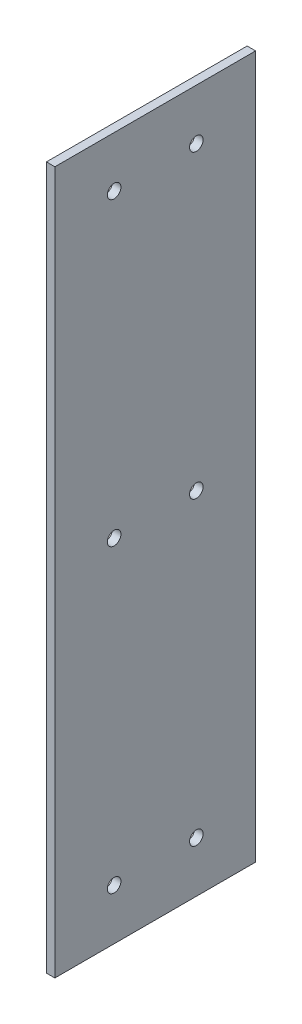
ISO-10303-21;
HEADER;
FILE_DESCRIPTION(('STEP AP214'),'2;1');
FILE_NAME('part.step','',(''),(''),'','','');
FILE_SCHEMA(('AUTOMOTIVE_DESIGN { 1 0 10303 214 1 1 1 1 }'));
ENDSEC;
DATA;
#1=APPLICATION_CONTEXT('core data for automotive mechanical design processes');
#2=APPLICATION_PROTOCOL_DEFINITION('international standard','automotive_design',2000,#1);
#3=PRODUCT_CONTEXT('',#1,'mechanical');
#4=PRODUCT('Part','Part','',(#3));
#5=PRODUCT_RELATED_PRODUCT_CATEGORY('part','',(#4));
#6=PRODUCT_DEFINITION_FORMATION('','',#4);
#7=PRODUCT_DEFINITION_CONTEXT('part definition',#1,'design');
#8=PRODUCT_DEFINITION('design','',#6,#7);
#9=PRODUCT_DEFINITION_SHAPE('','',#8);
#10=(LENGTH_UNIT() NAMED_UNIT(*) SI_UNIT(.MILLI.,.METRE.));
#11=(NAMED_UNIT(*) PLANE_ANGLE_UNIT() SI_UNIT($,.RADIAN.));
#12=(NAMED_UNIT(*) SI_UNIT($,.STERADIAN.) SOLID_ANGLE_UNIT());
#13=UNCERTAINTY_MEASURE_WITH_UNIT(LENGTH_MEASURE(1.E-05),#10,'distance_accuracy_value','');
#14=(GEOMETRIC_REPRESENTATION_CONTEXT(3) GLOBAL_UNCERTAINTY_ASSIGNED_CONTEXT((#13)) GLOBAL_UNIT_ASSIGNED_CONTEXT((#10,
#11,#12)) REPRESENTATION_CONTEXT('',''));
#15=CARTESIAN_POINT('',(0.,0.,0.));
#16=DIRECTION('',(0.,0.,1.));
#17=DIRECTION('',(1.,0.,0.));
#18=AXIS2_PLACEMENT_3D('',#15,#16,#17);
#19=CARTESIAN_POINT('',(10.,0.,0.));
#20=DIRECTION('',(1.,0.,0.));
#21=DIRECTION('',(0.,0.,-1.));
#22=AXIS2_PLACEMENT_3D('',#19,#20,#21);
#23=PLANE('',#22);
#24=CARTESIAN_POINT('',(10.,-59.9999989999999,2875.));
#25=DIRECTION('',(1.,0.,0.));
#26=DIRECTION('',(0.,0.,-1.));
#27=AXIS2_PLACEMENT_3D('',#24,#25,#26);
#28=CIRCLE('',#27,7.99999999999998);
#29=CARTESIAN_POINT('',(10.,-59.9999989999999,2867.));
#30=VERTEX_POINT('',#29);
#31=EDGE_CURVE('E136',#30,#30,#28,.T.);
#32=ORIENTED_EDGE('',*,*,#31,.F.);
#33=EDGE_LOOP('',(#32));
#34=FACE_BOUND('',#33,.T.);
#35=CARTESIAN_POINT('',(10.,-414.999992,2777.899981));
#36=DIRECTION('',(1.,0.,0.));
#37=DIRECTION('',(0.,0.,-1.));
#38=AXIS2_PLACEMENT_3D('',#35,#36,#37);
#39=CIRCLE('',#38,7.99999999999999);
#40=CARTESIAN_POINT('',(10.,-414.999992,2769.899981));
#41=VERTEX_POINT('',#40);
#42=EDGE_CURVE('E124',#41,#41,#39,.T.);
#43=ORIENTED_EDGE('',*,*,#42,.F.);
#44=EDGE_LOOP('',(#43));
#45=FACE_BOUND('',#44,.T.);
#46=CARTESIAN_POINT('',(10.,-769.999981,2875.));
#47=DIRECTION('',(1.,0.,0.));
#48=DIRECTION('',(0.,0.,-1.));
#49=AXIS2_PLACEMENT_3D('',#46,#47,#48);
#50=CIRCLE('',#49,7.99999999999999);
#51=CARTESIAN_POINT('',(10.,-769.999981,2867.));
#52=VERTEX_POINT('',#51);
#53=EDGE_CURVE('E103',#52,#52,#50,.T.);
#54=ORIENTED_EDGE('',*,*,#53,.F.);
#55=EDGE_LOOP('',(#54));
#56=FACE_BOUND('',#55,.T.);
#57=DIRECTION('',(0.,0.,1.));
#58=VECTOR('',#57,1.);
#59=CARTESIAN_POINT('',(10.,-0.18,2707.899094));
#60=LINE('',#59,#58);
#61=CARTESIAN_POINT('',(10.,-0.18,2707.899094));
#62=VERTEX_POINT('',#61);
#63=CARTESIAN_POINT('',(10.,-0.18,2944.997072));
#64=VERTEX_POINT('',#63);
#65=EDGE_CURVE('E88',#62,#64,#60,.T.);
#66=ORIENTED_EDGE('',*,*,#65,.T.);
#67=DIRECTION('',(0.,-1.,0.));
#68=VECTOR('',#67,1.);
#69=CARTESIAN_POINT('',(10.,-0.18,2944.997072));
#70=LINE('',#69,#68);
#71=CARTESIAN_POINT('',(10.,-829.999983,2944.997072));
#72=VERTEX_POINT('',#71);
#73=EDGE_CURVE('E83',#64,#72,#70,.T.);
#74=ORIENTED_EDGE('',*,*,#73,.T.);
#75=DIRECTION('',(0.,0.,-1.));
#76=VECTOR('',#75,1.);
#77=CARTESIAN_POINT('',(10.,-829.999983,2944.997072));
#78=LINE('',#77,#76);
#79=CARTESIAN_POINT('',(10.,-829.999983,2707.899094));
#80=VERTEX_POINT('',#79);
#81=EDGE_CURVE('E86',#72,#80,#78,.T.);
#82=ORIENTED_EDGE('',*,*,#81,.T.);
#83=DIRECTION('',(0.,1.,0.));
#84=VECTOR('',#83,1.);
#85=CARTESIAN_POINT('',(10.,-829.999983,2707.899094));
#86=LINE('',#85,#84);
#87=EDGE_CURVE('E53',#80,#62,#86,.T.);
#88=ORIENTED_EDGE('',*,*,#87,.T.);
#89=EDGE_LOOP('',(#66,#74,#82,#88));
#90=FACE_BOUND('',#89,.T.);
#91=CARTESIAN_POINT('',(10.,-769.999981,2777.899981));
#92=DIRECTION('',(1.,0.,0.));
#93=DIRECTION('',(0.,0.,-1.));
#94=AXIS2_PLACEMENT_3D('',#91,#92,#93);
#95=CIRCLE('',#94,7.99999999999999);
#96=CARTESIAN_POINT('',(10.,-769.999981,2769.899981));
#97=VERTEX_POINT('',#96);
#98=EDGE_CURVE('E118',#97,#97,#95,.T.);
#99=ORIENTED_EDGE('',*,*,#98,.F.);
#100=EDGE_LOOP('',(#99));
#101=FACE_BOUND('',#100,.T.);
#102=CARTESIAN_POINT('',(10.,-414.999992,2875.));
#103=DIRECTION('',(1.,0.,0.));
#104=DIRECTION('',(0.,0.,-1.));
#105=AXIS2_PLACEMENT_3D('',#102,#103,#104);
#106=CIRCLE('',#105,7.99999999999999);
#107=CARTESIAN_POINT('',(10.,-414.999992,2867.));
#108=VERTEX_POINT('',#107);
#109=EDGE_CURVE('E130',#108,#108,#106,.T.);
#110=ORIENTED_EDGE('',*,*,#109,.F.);
#111=EDGE_LOOP('',(#110));
#112=FACE_BOUND('',#111,.T.);
#113=CARTESIAN_POINT('',(10.,-59.9999990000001,2777.899981));
#114=DIRECTION('',(1.,0.,0.));
#115=DIRECTION('',(0.,0.,-1.));
#116=AXIS2_PLACEMENT_3D('',#113,#114,#115);
#117=CIRCLE('',#116,7.99999999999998);
#118=CARTESIAN_POINT('',(10.,-59.9999990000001,2769.899981));
#119=VERTEX_POINT('',#118);
#120=EDGE_CURVE('E142',#119,#119,#117,.T.);
#121=ORIENTED_EDGE('',*,*,#120,.F.);
#122=EDGE_LOOP('',(#121));
#123=FACE_BOUND('',#122,.T.);
#124=ADVANCED_FACE('F36',(#34,#45,#56,#90,#101,#112,#123),#23,.T.);
#125=CARTESIAN_POINT('',(0.,0.,0.));
#126=DIRECTION('',(1.,0.,0.));
#127=DIRECTION('',(0.,0.,-1.));
#128=AXIS2_PLACEMENT_3D('',#125,#126,#127);
#129=PLANE('',#128);
#130=DIRECTION('',(0.,0.,1.));
#131=VECTOR('',#130,1.);
#132=CARTESIAN_POINT('',(0.,-0.18,2707.899094));
#133=LINE('',#132,#131);
#134=CARTESIAN_POINT('',(0.,-0.18,2707.899094));
#135=VERTEX_POINT('',#134);
#136=CARTESIAN_POINT('',(0.,-0.18,2944.997072));
#137=VERTEX_POINT('',#136);
#138=EDGE_CURVE('E100',#135,#137,#133,.T.);
#139=ORIENTED_EDGE('',*,*,#138,.F.);
#140=DIRECTION('',(0.,1.,0.));
#141=VECTOR('',#140,1.);
#142=CARTESIAN_POINT('',(0.,-829.999983,2707.899094));
#143=LINE('',#142,#141);
#144=CARTESIAN_POINT('',(0.,-829.999983,2707.899094));
#145=VERTEX_POINT('',#144);
#146=EDGE_CURVE('E76',#145,#135,#143,.T.);
#147=ORIENTED_EDGE('',*,*,#146,.F.);
#148=DIRECTION('',(0.,0.,-1.));
#149=VECTOR('',#148,1.);
#150=CARTESIAN_POINT('',(0.,-829.999983,2944.997072));
#151=LINE('',#150,#149);
#152=CARTESIAN_POINT('',(0.,-829.999983,2944.997072));
#153=VERTEX_POINT('',#152);
#154=EDGE_CURVE('E70',#153,#145,#151,.T.);
#155=ORIENTED_EDGE('',*,*,#154,.F.);
#156=DIRECTION('',(0.,-1.,0.));
#157=VECTOR('',#156,1.);
#158=CARTESIAN_POINT('',(0.,-0.18,2944.997072));
#159=LINE('',#158,#157);
#160=EDGE_CURVE('E92',#137,#153,#159,.T.);
#161=ORIENTED_EDGE('',*,*,#160,.F.);
#162=EDGE_LOOP('',(#139,#147,#155,#161));
#163=FACE_BOUND('',#162,.T.);
#164=CARTESIAN_POINT('',(0.,-769.999981,2875.));
#165=DIRECTION('',(1.,0.,0.));
#166=DIRECTION('',(0.,0.,-1.));
#167=AXIS2_PLACEMENT_3D('',#164,#165,#166);
#168=CIRCLE('',#167,7.99999999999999);
#169=CARTESIAN_POINT('',(0.,-769.999981,2867.));
#170=VERTEX_POINT('',#169);
#171=EDGE_CURVE('E115',#170,#170,#168,.T.);
#172=ORIENTED_EDGE('',*,*,#171,.T.);
#173=EDGE_LOOP('',(#172));
#174=FACE_BOUND('',#173,.T.);
#175=CARTESIAN_POINT('',(0.,-769.999981,2777.899981));
#176=DIRECTION('',(1.,0.,0.));
#177=DIRECTION('',(0.,0.,-1.));
#178=AXIS2_PLACEMENT_3D('',#175,#176,#177);
#179=CIRCLE('',#178,7.99999999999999);
#180=CARTESIAN_POINT('',(0.,-769.999981,2769.899981));
#181=VERTEX_POINT('',#180);
#182=EDGE_CURVE('E121',#181,#181,#179,.T.);
#183=ORIENTED_EDGE('',*,*,#182,.T.);
#184=EDGE_LOOP('',(#183));
#185=FACE_BOUND('',#184,.T.);
#186=CARTESIAN_POINT('',(0.,-414.999992,2777.899981));
#187=DIRECTION('',(1.,0.,0.));
#188=DIRECTION('',(0.,0.,-1.));
#189=AXIS2_PLACEMENT_3D('',#186,#187,#188);
#190=CIRCLE('',#189,7.99999999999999);
#191=CARTESIAN_POINT('',(0.,-414.999992,2769.899981));
#192=VERTEX_POINT('',#191);
#193=EDGE_CURVE('E127',#192,#192,#190,.T.);
#194=ORIENTED_EDGE('',*,*,#193,.T.);
#195=EDGE_LOOP('',(#194));
#196=FACE_BOUND('',#195,.T.);
#197=CARTESIAN_POINT('',(0.,-414.999992,2875.));
#198=DIRECTION('',(1.,0.,0.));
#199=DIRECTION('',(0.,0.,-1.));
#200=AXIS2_PLACEMENT_3D('',#197,#198,#199);
#201=CIRCLE('',#200,7.99999999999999);
#202=CARTESIAN_POINT('',(0.,-414.999992,2867.));
#203=VERTEX_POINT('',#202);
#204=EDGE_CURVE('E133',#203,#203,#201,.T.);
#205=ORIENTED_EDGE('',*,*,#204,.T.);
#206=EDGE_LOOP('',(#205));
#207=FACE_BOUND('',#206,.T.);
#208=CARTESIAN_POINT('',(0.,-59.9999989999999,2875.));
#209=DIRECTION('',(1.,0.,0.));
#210=DIRECTION('',(0.,0.,-1.));
#211=AXIS2_PLACEMENT_3D('',#208,#209,#210);
#212=CIRCLE('',#211,7.99999999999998);
#213=CARTESIAN_POINT('',(0.,-59.9999989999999,2867.));
#214=VERTEX_POINT('',#213);
#215=EDGE_CURVE('E139',#214,#214,#212,.T.);
#216=ORIENTED_EDGE('',*,*,#215,.T.);
#217=EDGE_LOOP('',(#216));
#218=FACE_BOUND('',#217,.T.);
#219=CARTESIAN_POINT('',(0.,-59.9999990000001,2777.899981));
#220=DIRECTION('',(1.,0.,0.));
#221=DIRECTION('',(0.,0.,-1.));
#222=AXIS2_PLACEMENT_3D('',#219,#220,#221);
#223=CIRCLE('',#222,7.99999999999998);
#224=CARTESIAN_POINT('',(0.,-59.9999990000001,2769.899981));
#225=VERTEX_POINT('',#224);
#226=EDGE_CURVE('E145',#225,#225,#223,.T.);
#227=ORIENTED_EDGE('',*,*,#226,.T.);
#228=EDGE_LOOP('',(#227));
#229=FACE_BOUND('',#228,.T.);
#230=ADVANCED_FACE('F111',(#163,#174,#185,#196,#207,#218,#229),#129,.F.);
#231=CARTESIAN_POINT('',(10.,-0.18,2707.899094));
#232=DIRECTION('',(0.,-1.,0.));
#233=DIRECTION('',(0.,0.,-1.));
#234=AXIS2_PLACEMENT_3D('',#231,#232,#233);
#235=PLANE('',#234);
#236=ORIENTED_EDGE('',*,*,#138,.T.);
#237=DIRECTION('',(-1.,0.,0.));
#238=VECTOR('',#237,1.);
#239=CARTESIAN_POINT('',(10.,-0.18,2944.997072));
#240=LINE('',#239,#238);
#241=EDGE_CURVE('E11',#64,#137,#240,.T.);
#242=ORIENTED_EDGE('',*,*,#241,.F.);
#243=ORIENTED_EDGE('',*,*,#65,.F.);
#244=DIRECTION('',(-1.,0.,0.));
#245=VECTOR('',#244,1.);
#246=CARTESIAN_POINT('',(10.,-0.18,2707.899094));
#247=LINE('',#246,#245);
#248=EDGE_CURVE('E96',#62,#135,#247,.T.);
#249=ORIENTED_EDGE('',*,*,#248,.T.);
#250=EDGE_LOOP('',(#236,#242,#243,#249));
#251=FACE_BOUND('',#250,.T.);
#252=ADVANCED_FACE('F38',(#251),#235,.F.);
#253=CARTESIAN_POINT('',(10.,-0.18,2944.997072));
#254=DIRECTION('',(0.,0.,-1.));
#255=DIRECTION('',(-1.,0.,0.));
#256=AXIS2_PLACEMENT_3D('',#253,#254,#255);
#257=PLANE('',#256);
#258=ORIENTED_EDGE('',*,*,#160,.T.);
#259=DIRECTION('',(-1.,0.,0.));
#260=VECTOR('',#259,1.);
#261=CARTESIAN_POINT('',(10.,-829.999983,2944.997072));
#262=LINE('',#261,#260);
#263=EDGE_CURVE('E45',#72,#153,#262,.T.);
#264=ORIENTED_EDGE('',*,*,#263,.F.);
#265=ORIENTED_EDGE('',*,*,#73,.F.);
#266=ORIENTED_EDGE('',*,*,#241,.T.);
#267=EDGE_LOOP('',(#258,#264,#265,#266));
#268=FACE_BOUND('',#267,.T.);
#269=ADVANCED_FACE('F91',(#268),#257,.F.);
#270=CARTESIAN_POINT('',(10.,-829.999983,2944.997072));
#271=DIRECTION('',(0.,1.,0.));
#272=DIRECTION('',(0.,0.,1.));
#273=AXIS2_PLACEMENT_3D('',#270,#271,#272);
#274=PLANE('',#273);
#275=ORIENTED_EDGE('',*,*,#154,.T.);
#276=DIRECTION('',(-1.,0.,0.));
#277=VECTOR('',#276,1.);
#278=CARTESIAN_POINT('',(10.,-829.999983,2707.899094));
#279=LINE('',#278,#277);
#280=EDGE_CURVE('E93',#80,#145,#279,.T.);
#281=ORIENTED_EDGE('',*,*,#280,.F.);
#282=ORIENTED_EDGE('',*,*,#81,.F.);
#283=ORIENTED_EDGE('',*,*,#263,.T.);
#284=EDGE_LOOP('',(#275,#281,#282,#283));
#285=FACE_BOUND('',#284,.T.);
#286=ADVANCED_FACE('F94',(#285),#274,.F.);
#287=CARTESIAN_POINT('',(10.,-829.999983,2707.899094));
#288=DIRECTION('',(0.,0.,1.));
#289=DIRECTION('',(1.,0.,0.));
#290=AXIS2_PLACEMENT_3D('',#287,#288,#289);
#291=PLANE('',#290);
#292=ORIENTED_EDGE('',*,*,#146,.T.);
#293=ORIENTED_EDGE('',*,*,#248,.F.);
#294=ORIENTED_EDGE('',*,*,#87,.F.);
#295=ORIENTED_EDGE('',*,*,#280,.T.);
#296=EDGE_LOOP('',(#292,#293,#294,#295));
#297=FACE_BOUND('',#296,.T.);
#298=ADVANCED_FACE('F108',(#297),#291,.F.);
#299=CARTESIAN_POINT('',(10.,-769.999981,2875.));
#300=DIRECTION('',(-1.,0.,0.));
#301=DIRECTION('',(0.,0.,1.));
#302=AXIS2_PLACEMENT_3D('',#299,#300,#301);
#303=CYLINDRICAL_SURFACE('',#302,7.99999999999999);
#304=ORIENTED_EDGE('',*,*,#53,.T.);
#305=EDGE_LOOP('',(#304));
#306=FACE_BOUND('',#305,.T.);
#307=ORIENTED_EDGE('',*,*,#171,.F.);
#308=EDGE_LOOP('',(#307));
#309=FACE_BOUND('',#308,.T.);
#310=ADVANCED_FACE('F164',(#306,#309),#303,.F.);
#311=CARTESIAN_POINT('',(10.,-769.999981,2777.899981));
#312=DIRECTION('',(-1.,0.,0.));
#313=DIRECTION('',(0.,0.,1.));
#314=AXIS2_PLACEMENT_3D('',#311,#312,#313);
#315=CYLINDRICAL_SURFACE('',#314,7.99999999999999);
#316=ORIENTED_EDGE('',*,*,#98,.T.);
#317=EDGE_LOOP('',(#316));
#318=FACE_BOUND('',#317,.T.);
#319=ORIENTED_EDGE('',*,*,#182,.F.);
#320=EDGE_LOOP('',(#319));
#321=FACE_BOUND('',#320,.T.);
#322=ADVANCED_FACE('F210',(#318,#321),#315,.F.);
#323=CARTESIAN_POINT('',(10.,-414.999992,2777.899981));
#324=DIRECTION('',(-1.,0.,0.));
#325=DIRECTION('',(0.,0.,1.));
#326=AXIS2_PLACEMENT_3D('',#323,#324,#325);
#327=CYLINDRICAL_SURFACE('',#326,7.99999999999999);
#328=ORIENTED_EDGE('',*,*,#42,.T.);
#329=EDGE_LOOP('',(#328));
#330=FACE_BOUND('',#329,.T.);
#331=ORIENTED_EDGE('',*,*,#193,.F.);
#332=EDGE_LOOP('',(#331));
#333=FACE_BOUND('',#332,.T.);
#334=ADVANCED_FACE('F218',(#330,#333),#327,.F.);
#335=CARTESIAN_POINT('',(10.,-414.999992,2875.));
#336=DIRECTION('',(-1.,0.,0.));
#337=DIRECTION('',(0.,0.,1.));
#338=AXIS2_PLACEMENT_3D('',#335,#336,#337);
#339=CYLINDRICAL_SURFACE('',#338,7.99999999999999);
#340=ORIENTED_EDGE('',*,*,#109,.T.);
#341=EDGE_LOOP('',(#340));
#342=FACE_BOUND('',#341,.T.);
#343=ORIENTED_EDGE('',*,*,#204,.F.);
#344=EDGE_LOOP('',(#343));
#345=FACE_BOUND('',#344,.T.);
#346=ADVANCED_FACE('F226',(#342,#345),#339,.F.);
#347=CARTESIAN_POINT('',(10.,-59.9999989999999,2875.));
#348=DIRECTION('',(-1.,0.,0.));
#349=DIRECTION('',(0.,0.,1.));
#350=AXIS2_PLACEMENT_3D('',#347,#348,#349);
#351=CYLINDRICAL_SURFACE('',#350,7.99999999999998);
#352=ORIENTED_EDGE('',*,*,#31,.T.);
#353=EDGE_LOOP('',(#352));
#354=FACE_BOUND('',#353,.T.);
#355=ORIENTED_EDGE('',*,*,#215,.F.);
#356=EDGE_LOOP('',(#355));
#357=FACE_BOUND('',#356,.T.);
#358=ADVANCED_FACE('F235',(#354,#357),#351,.F.);
#359=CARTESIAN_POINT('',(10.,-59.9999990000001,2777.899981));
#360=DIRECTION('',(-1.,0.,0.));
#361=DIRECTION('',(0.,0.,1.));
#362=AXIS2_PLACEMENT_3D('',#359,#360,#361);
#363=CYLINDRICAL_SURFACE('',#362,7.99999999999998);
#364=ORIENTED_EDGE('',*,*,#120,.T.);
#365=EDGE_LOOP('',(#364));
#366=FACE_BOUND('',#365,.T.);
#367=ORIENTED_EDGE('',*,*,#226,.F.);
#368=EDGE_LOOP('',(#367));
#369=FACE_BOUND('',#368,.T.);
#370=ADVANCED_FACE('F151',(#366,#369),#363,.F.);
#371=CLOSED_SHELL('',(#124,#230,#252,#269,#286,#298,#310,#322,#334,#346,#358,#370));
#372=MANIFOLD_SOLID_BREP('B2',#371);
#373=ADVANCED_BREP_SHAPE_REPRESENTATION('',(#18,#372),#14);
#374=SHAPE_DEFINITION_REPRESENTATION(#9,#373);
ENDSEC;
END-ISO-10303-21;
